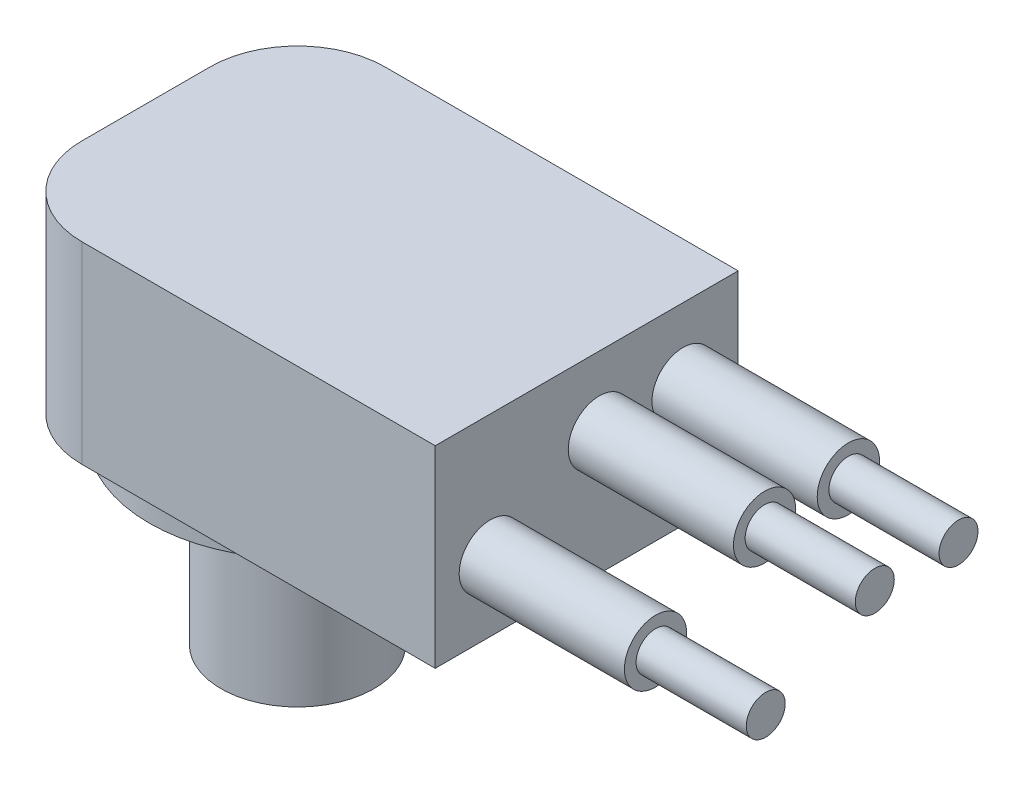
from build123d import *

# Parameters (mm, degrees)
SKETCH1_W           = 32
SKETCH1_H           = 14
BASE_EXTRUDE_DEPTH  = 11
SKETCH2_R           = 10.755
BOSS_EXTRUDE1_DEPTH = 1.5
SKETCH3_R           = 5.55625
BOSS_EXTRUDE2_DEPTH = 13.0048
FILLET3_R           = 6.35
SKETCH4_R           = 2.261
BOSS_EXTRUDE3_DEPTH = 12
SKETCH6_R           = 1.415
BOSS_EXTRUDE4_DEPTH = 8
SKETCH5_R           = 0.89


with BuildPart() as part:
    # Sketch1 → Base-Extrude (new, symmetric)
    with BuildSketch(Plane.XY):
        with Locations((16, 7)):
            Rectangle(SKETCH1_W, SKETCH1_H)
    extrude(amount=BASE_EXTRUDE_DEPTH, both=True)

    # Sketch2 → Boss-Extrude1 (add)
    with BuildSketch(Plane.XZ):
        with Locations(Location((11, 0, 0), (0, 0, 90))):
            Circle(SKETCH2_R)
    extrude(amount=BOSS_EXTRUDE1_DEPTH)

    # Sketch3 → Boss-Extrude2 (add)
    with BuildSketch(Plane.XZ.offset(1.5)):
        with Locations(Location((11, 0, 0), (0, 0, 270))):
            Circle(SKETCH3_R)
    extrude(amount=BOSS_EXTRUDE2_DEPTH)

    # Fillet3
    fillet3_edges = [part.edges().sort_by_distance(p)[0] for p in [
        (0, 7, 11),
        (0, 7, -11),
    ]]
    fillet(fillet3_edges, radius=FILLET3_R)

    # Sketch4 → Boss-Extrude3 (add)
    with BuildSketch(Plane(origin=(32, 0, 0), x_dir=(0, 0, -1), z_dir=(1, 0, 0))):
        with Locations(Location((0.92, 8.92, 0), (0, 0, 180))):
            Circle(SKETCH4_R)
        with Locations(Location((7, 8.92, 0), (0, 0, 180))):
            Circle(SKETCH4_R)
        with Locations(Location((-7, 5.08, 0), (0, 0, 180))):
            Circle(SKETCH4_R)
    extrude(amount=BOSS_EXTRUDE3_DEPTH)

    # Sketch6 → Boss-Extrude4 (add)
    with BuildSketch(Plane(origin=(44, 0, 0), x_dir=(0, 0, -1), z_dir=(1, 0, 0))):
        with Locations((7, 8.92)):
            Circle(SKETCH6_R)
        with Locations((-7, 5.08)):
            Circle(SKETCH6_R)
        with Locations((0.92, 8.92)):
            Circle(SKETCH6_R)
    extrude(amount=BOSS_EXTRUDE4_DEPTH)

    # Sketch5 → Revolve1 (revolve)
    with BuildSketch(Plane(origin=(11, 0, 0), x_dir=(0, 0, -1), z_dir=(1, 0, 0)), mode=Mode.PRIVATE) as revolve1_sk:
        with Locations((7.1, -1.5)):
            Circle(SKETCH5_R)
    revolve(revolve1_sk.sketch.rotate(Axis((11, 0, 0), (0, -1, 0)), 180), axis=Axis((11, 0, 0), (0, -1, 0)))


solid = part.part
